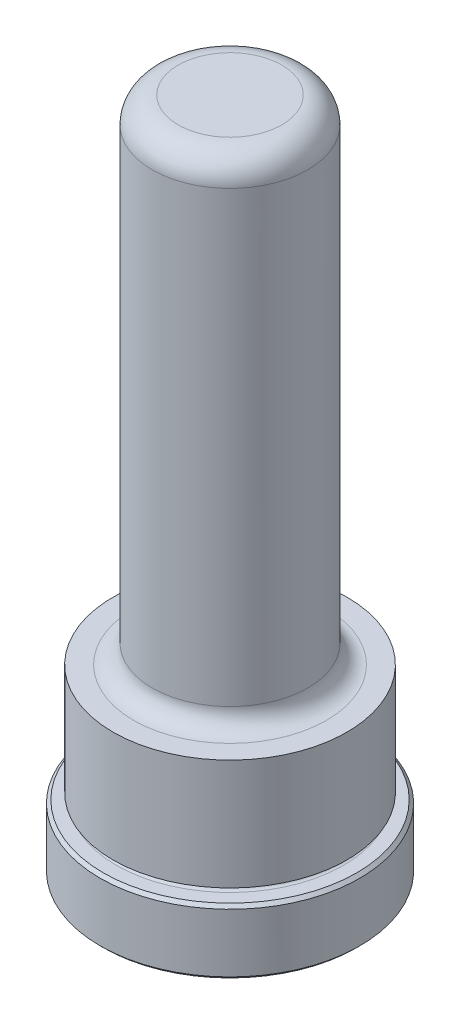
from build123d import *

# Parameters (mm, degrees)
CHAMFER1_SIZE = 0.381
FILLET1_R     = 3.175


with BuildPart() as part:
    # Sketch1 → Revolve1 (revolve)
    with BuildSketch(Plane(origin=(0, 0, 0), x_dir=(0, 0, -1), z_dir=(1, 0, 0)), mode=Mode.PRIVATE) as revolve1_sk:
        with BuildLine():
            Line((0, 0), (15.875, 0))
            Line((15.875, 0), (15.875, 7.9248))
            Line((15.875, 7.9248), (13.8938, 7.9248))
            ThreePointArc((13.8938, 7.9248), (13.5128, 8.3058), (13.8938, 8.6868))
            Line((13.8938, 8.6868), (14.3002, 8.6868))
            Line((14.3002, 8.6868), (14.3002, 22.225))
            Line((14.3002, 22.225), (11.7983, 22.225))
            ThreePointArc((11.7983, 22.225), (10.181853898, 22.894553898), (9.5123, 24.511))
            Line((9.5123, 24.511), (9.5123, 82.55))
            Line((9.5123, 82.55), (0, 82.55))
            Line((0, 82.55), (0, 0))
        make_face()
    revolve(revolve1_sk.sketch.rotate(Axis((0, 0, 0), (0, -1, 0)), 180), axis=Axis((0, 0, 0), (0, -1, 0)))

    # Chamfer1
    chamfer1_edges = [part.edges().sort_by_distance(p)[0] for p in [
        (0, 7.9248, -15.875),
        (0, 0, -15.875),
    ]]
    chamfer(chamfer1_edges, length=CHAMFER1_SIZE)

    # Fillet1
    fillet1_edges = [part.edges().sort_by_distance(p)[0] for p in [
        (0, 82.55, -9.5123),
    ]]
    fillet(fillet1_edges, radius=FILLET1_R)


solid = part.part
